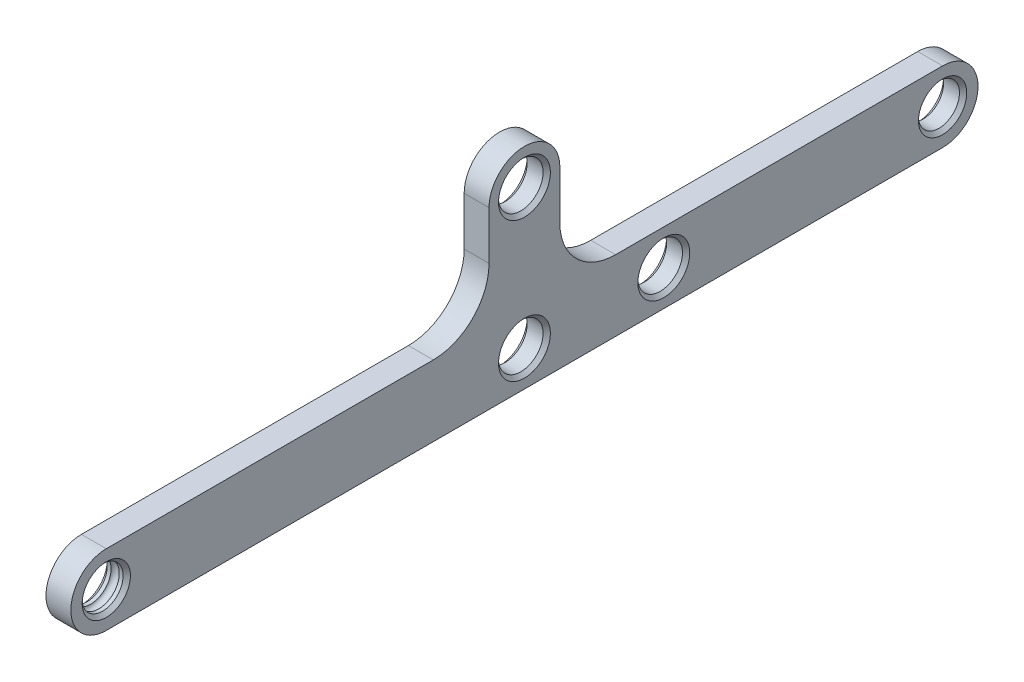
from build123d import *

# Parameters (mm, degrees)
SKETCH1_R           = 3.675
SKETCH1_R_2         = 4
BOSS_EXTRUDE1_DEPTH = 4.7625
CHAMFER1_SIZE       = 0.9525
SKETCH2_R           = 0.79375
CUT_EXTRUDE1_START  = -0.3
CUT_EXTRUDE1_DEPTH  = 0.3
FILLET1_R           = 10


with BuildPart() as part:
    # Sketch1 → Boss-Extrude1 (new body)
    with BuildSketch(Plane(origin=(0, 0, 0), x_dir=(0, 0, -1), z_dir=(1, 0, 0))):
        with BuildLine():
            Line((68.65, 6.35), (0, 6.35))
            ThreePointArc((0, 6.35), (-6.35, 0), (0, -6.35))
            Line((0, -6.35), (150, -6.35))
            ThreePointArc((150, -6.35), (156.35, 0), (150, 6.35))
            Line((150, 6.35), (81.35, 6.35))
            Line((81.35, 6.35), (81.35, 25))
            ThreePointArc((81.35, 25), (75, 31.35), (68.65, 25))
            Line((68.65, 25), (68.65, 6.35))
        make_face()
        with Locations(Location((0, 0, 0), (0, 0, 180))):
            Circle(SKETCH1_R, mode=Mode.SUBTRACT)
        with Locations(Location((75, 0, 0), (0, 0, 180))):
            Circle(SKETCH1_R_2, mode=Mode.SUBTRACT)
        with Locations(Location((75, 25, 0), (0, 0, 180))):
            Circle(SKETCH1_R_2, mode=Mode.SUBTRACT)
        with Locations(Location((150, 0, 0), (0, 0, 180))):
            Circle(SKETCH1_R, mode=Mode.SUBTRACT)
        with Locations(Location((100, 0, 0), (0, 0, 180))):
            Circle(SKETCH1_R_2, mode=Mode.SUBTRACT)
    extrude(amount=BOSS_EXTRUDE1_DEPTH)

    # Chamfer1
    chamfer1_edges = [part.edges().sort_by_distance(p)[0] for p in [
        (0, 0, -153.675),
        (0, 0, -104),
        (0, 25, -79),
        (0, 0, -79),
        (0, 0, -3.675),
        (4.7625, 0, -3.675),
        (4.7625, 0, -79),
        (4.7625, 25, -79),
        (4.7625, 0, -104),
        (4.7625, 0, -153.675),
    ]]
    chamfer(chamfer1_edges, length=CHAMFER1_SIZE)

    # Sketch2 → Cut-Revolve1 (revolve, cut)
    with BuildSketch(Plane(origin=(0, 0, 0), x_dir=(1, 0, 0), z_dir=(0, 1, 0))):
        with Locations((2.38125, -3.375)):
            Circle(SKETCH2_R)
    revolve(axis=Axis((0.4525, 0, 0), (1, 0, 0)), mode=Mode.SUBTRACT)

    # Sketch5 → Cut-Extrude1 (cut)
    with BuildSketch(Plane(origin=(4.7625, 0, 0), x_dir=(0, 0, -1), z_dir=(1, 0, 0)).offset(CUT_EXTRUDE1_START)):
        with BuildLine():
            Line((0, -6.35), (150, -6.35))
            ThreePointArc((150, -6.35), (156.35, 0), (150, 6.35))
            Line((150, 6.35), (81.35, 6.35))
            Line((81.35, 6.35), (81.35, 25))
            ThreePointArc((81.35, 25), (75, 31.35), (68.65, 25))
            Line((68.65, 25), (68.65, 6.35))
            Line((68.65, 6.35), (0, 6.35))
            ThreePointArc((0, 6.35), (-6.35, 0), (0, -6.35))
        make_face()
    extrude(amount=CUT_EXTRUDE1_DEPTH, mode=Mode.SUBTRACT)

    # Fillet1
    fillet1_edges = [part.edges().sort_by_distance(p)[0] for p in [
        (2.23125, 6.35, -68.65),
        (2.23125, 6.35, -81.35),
    ]]
    fillet(fillet1_edges, radius=FILLET1_R)


solid = part.part
